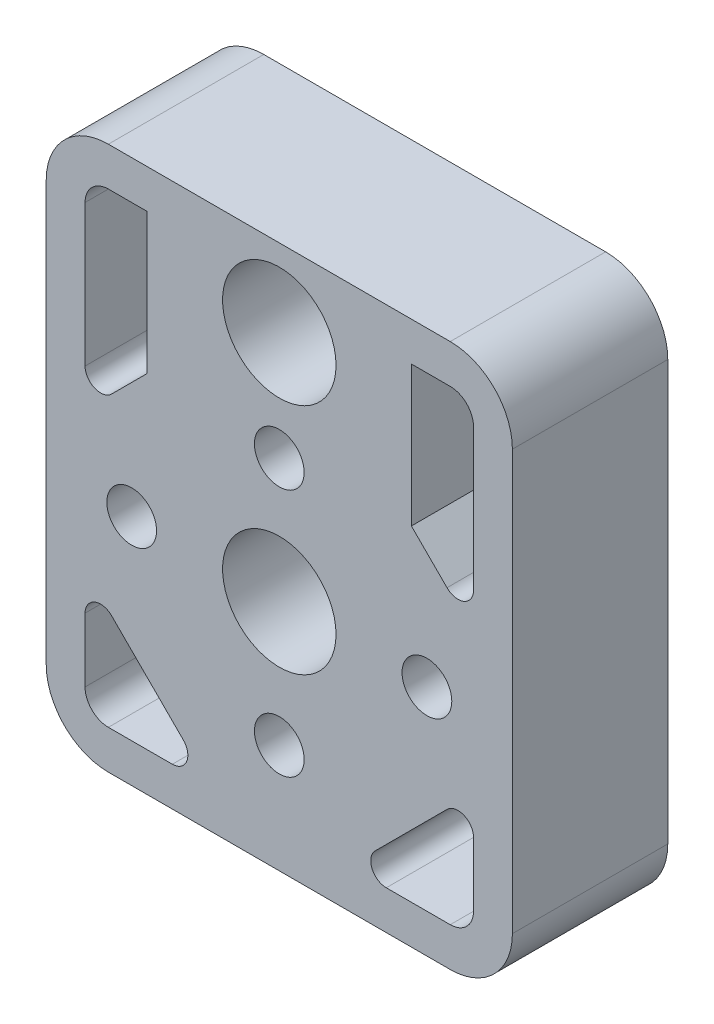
from build123d import *

# Parameters (mm, degrees)
SKETCH1_W           = 30
SKETCH1_H           = 35
SKETCH1_R           = 2.05
SKETCH1_R_2         = 2.1
SKETCH1_R_3         = 1.6
BOSS_EXTRUDE1_DEPTH = 10
SKETCH2_R           = 2.85
CUT_EXTRUDE1_DEPTH  = 5
SKETCH3_R           = 3.65
CUT_EXTRUDE2_DEPTH  = 7
FILLET1_R           = 4
CUT_EXTRUDE3_DEPTH  = 48.16990566


with BuildPart() as part:
    # Sketch1 → Boss-Extrude1 (new body)
    with BuildSketch(Plane.XY):
        with Locations((15, 17.5)):
            Rectangle(SKETCH1_W, SKETCH1_H)
        with Locations((15, 30)):
            Circle(SKETCH1_R, mode=Mode.SUBTRACT)
        with Locations((15, 15)):
            Circle(SKETCH1_R_2, mode=Mode.SUBTRACT)
        with Locations((5.5, 15)):
            Circle(SKETCH1_R_3, mode=Mode.SUBTRACT)
        with Locations((24.5, 15)):
            Circle(SKETCH1_R_3, mode=Mode.SUBTRACT)
        with Locations((15, 7)):
            Circle(SKETCH1_R_3, mode=Mode.SUBTRACT)
        with Locations((15, 23)):
            Circle(SKETCH1_R_3, mode=Mode.SUBTRACT)
    extrude(amount=BOSS_EXTRUDE1_DEPTH)

    # Sketch2 → Cut-Extrude1 (cut)
    with BuildSketch(Plane(origin=(0, 0, 0), x_dir=(-1, 0, 0), z_dir=(0, 0, -1))):
        with Locations((-15, 7)):
            Circle(SKETCH2_R)
        with Locations((-24.5, 15)):
            Circle(SKETCH2_R)
        with Locations((-15, 23)):
            Circle(SKETCH2_R)
        with Locations((-5.5, 15)):
            Circle(SKETCH2_R)
    extrude(amount=-CUT_EXTRUDE1_DEPTH, mode=Mode.SUBTRACT)

    # Sketch3 → Cut-Extrude2 (cut)
    with BuildSketch(Plane.XY.offset(10)):
        with Locations((15, 15)):
            Circle(SKETCH3_R)
        with Locations((15, 30)):
            Circle(SKETCH3_R)
    extrude(amount=-CUT_EXTRUDE2_DEPTH, mode=Mode.SUBTRACT)

    # Fillet1
    fillet1_edges = [part.edges().sort_by_distance(p)[0] for p in [
        (0, 35, 5),
        (30, 35, 5),
        (30, 0, 5),
        (0, 0, 5),
    ]]
    fillet(fillet1_edges, radius=FILLET1_R)

    # Sketch5 → Cut-Extrude3 (cut, through all)
    with BuildSketch(Plane.XY.offset(10)):
        with BuildLine():
            Line((6.5, 32.5), (6.5, 23.470562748))
            Line((6.5, 23.470562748), (4.207106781, 21.17766953))
            ThreePointArc((4.207106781, 21.17766953), (3.117316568, 20.960896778), (2.5, 21.884776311))
            Line((2.5, 21.884776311), (2.5, 31))
            ThreePointArc((2.5, 31), (2.939339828, 32.060660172), (4, 32.5))
            Line((4, 32.5), (6.5, 32.5))
        make_face()
        with BuildLine():
            Line((4.207106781, 8.82233047), (8.82233047, 4.207106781))
            ThreePointArc((8.82233047, 4.207106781), (9.039103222, 3.117316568), (8.115223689, 2.5))
            Line((8.115223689, 2.5), (4, 2.5))
            ThreePointArc((4, 2.5), (2.939339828, 2.939339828), (2.5, 4))
            Line((2.5, 4), (2.5, 8.115223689))
            ThreePointArc((2.5, 8.115223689), (3.117316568, 9.039103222), (4.207106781, 8.82233047))
        make_face()
        with BuildLine():
            Line((26, 2.5), (21.884776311, 2.5))
            ThreePointArc((21.884776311, 2.5), (20.960896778, 3.117316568), (21.17766953, 4.207106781))
            Line((21.17766953, 4.207106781), (25.792893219, 8.82233047))
            ThreePointArc((25.792893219, 8.82233047), (26.882683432, 9.039103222), (27.5, 8.115223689))
            Line((27.5, 8.115223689), (27.5, 4))
            ThreePointArc((27.5, 4), (27.060660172, 2.939339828), (26, 2.5))
        make_face()
        with BuildLine():
            Line((23.5, 32.5), (26, 32.5))
            ThreePointArc((26, 32.5), (27.060660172, 32.060660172), (27.5, 31))
            Line((27.5, 31), (27.5, 21.884776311))
            ThreePointArc((27.5, 21.884776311), (26.882683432, 20.960896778), (25.792893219, 21.17766953))
            Line((25.792893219, 21.17766953), (23.5, 23.470562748))
            Line((23.5, 23.470562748), (23.5, 32.5))
        make_face()
    extrude(amount=-CUT_EXTRUDE3_DEPTH, mode=Mode.SUBTRACT)


solid = part.part
